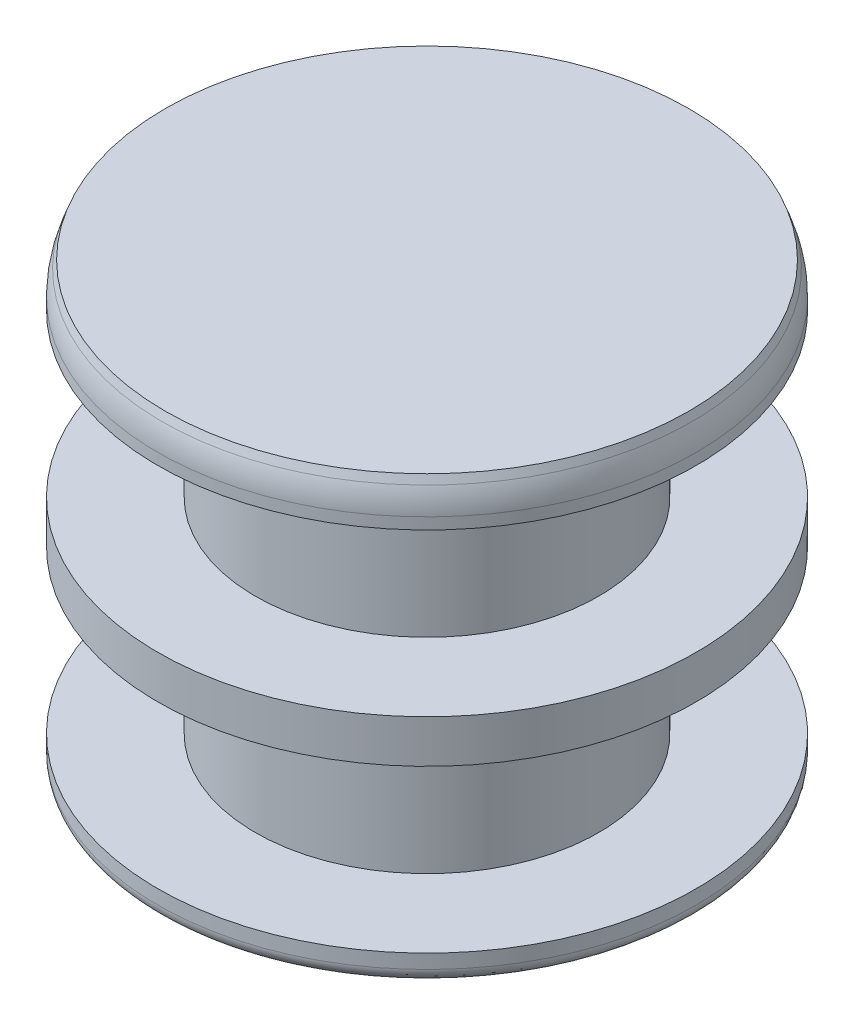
ISO-10303-21;
HEADER;
FILE_DESCRIPTION(('STEP AP214'),'2;1');
FILE_NAME('part.step','',(''),(''),'','','');
FILE_SCHEMA(('AUTOMOTIVE_DESIGN { 1 0 10303 214 1 1 1 1 }'));
ENDSEC;
DATA;
#1=APPLICATION_CONTEXT('core data for automotive mechanical design processes');
#2=APPLICATION_PROTOCOL_DEFINITION('international standard','automotive_design',2000,#1);
#3=PRODUCT_CONTEXT('',#1,'mechanical');
#4=PRODUCT('Part','Part','',(#3));
#5=PRODUCT_RELATED_PRODUCT_CATEGORY('part','',(#4));
#6=PRODUCT_DEFINITION_FORMATION('','',#4);
#7=PRODUCT_DEFINITION_CONTEXT('part definition',#1,'design');
#8=PRODUCT_DEFINITION('design','',#6,#7);
#9=PRODUCT_DEFINITION_SHAPE('','',#8);
#10=(LENGTH_UNIT() NAMED_UNIT(*) SI_UNIT(.MILLI.,.METRE.));
#11=(NAMED_UNIT(*) PLANE_ANGLE_UNIT() SI_UNIT($,.RADIAN.));
#12=(NAMED_UNIT(*) SI_UNIT($,.STERADIAN.) SOLID_ANGLE_UNIT());
#13=UNCERTAINTY_MEASURE_WITH_UNIT(LENGTH_MEASURE(1.E-05),#10,'distance_accuracy_value','');
#14=(GEOMETRIC_REPRESENTATION_CONTEXT(3) GLOBAL_UNCERTAINTY_ASSIGNED_CONTEXT((#13)) GLOBAL_UNIT_ASSIGNED_CONTEXT((#10,
#11,#12)) REPRESENTATION_CONTEXT('',''));
#15=CARTESIAN_POINT('',(0.,0.,0.));
#16=DIRECTION('',(0.,0.,1.));
#17=DIRECTION('',(1.,0.,0.));
#18=AXIS2_PLACEMENT_3D('',#15,#16,#17);
#19=CARTESIAN_POINT('',(3.66,0.,0.));
#20=DIRECTION('',(0.,-1.,0.));
#21=DIRECTION('',(1.,0.,0.));
#22=AXIS2_PLACEMENT_3D('',#19,#20,#21);
#23=PLANE('',#22);
#24=CARTESIAN_POINT('',(0.,0.,0.));
#25=DIRECTION('',(0.,1.,0.));
#26=DIRECTION('',(-1.,0.,0.));
#27=AXIS2_PLACEMENT_3D('',#24,#25,#26);
#28=CIRCLE('',#27,3.66);
#29=CARTESIAN_POINT('',(-3.66,0.,0.));
#30=VERTEX_POINT('',#29);
#31=EDGE_CURVE('E81',#30,#30,#28,.T.);
#32=ORIENTED_EDGE('',*,*,#31,.T.);
#33=EDGE_LOOP('',(#32));
#34=FACE_BOUND('',#33,.T.);
#35=ADVANCED_FACE('F34',(#34),#23,.F.);
#36=CARTESIAN_POINT('',(0.500000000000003,-7.99956969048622,0.));
#37=DIRECTION('',(0.,1.,0.));
#38=DIRECTION('',(-1.,0.,0.));
#39=AXIS2_PLACEMENT_3D('',#36,#37,#38);
#40=PLANE('',#39);
#41=CARTESIAN_POINT('',(0.,-7.99956969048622,0.));
#42=DIRECTION('',(0.,1.,0.));
#43=DIRECTION('',(-1.,0.,0.));
#44=AXIS2_PLACEMENT_3D('',#41,#42,#43);
#45=CIRCLE('',#44,0.5);
#46=CARTESIAN_POINT('',(-0.499999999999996,-7.99956969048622,0.));
#47=VERTEX_POINT('',#46);
#48=EDGE_CURVE('E54',#47,#47,#45,.T.);
#49=ORIENTED_EDGE('',*,*,#48,.F.);
#50=EDGE_LOOP('',(#49));
#51=FACE_BOUND('',#50,.T.);
#52=ADVANCED_FACE('F99',(#51),#40,.F.);
#53=CARTESIAN_POINT('',(0.,-7.99956969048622,0.));
#54=DIRECTION('',(0.,1.,0.));
#55=DIRECTION('',(-1.,0.,0.));
#56=AXIS2_PLACEMENT_3D('',#53,#54,#55);
#57=CONICAL_SURFACE('',#56,0.5,1.02974425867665);
#58=CARTESIAN_POINT('',(0.,-6.09904297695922,0.));
#59=DIRECTION('',(0.,-1.,0.));
#60=DIRECTION('',(1.,0.,0.));
#61=AXIS2_PLACEMENT_3D('',#58,#59,#60);
#62=CIRCLE('',#61,3.66300761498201);
#63=CARTESIAN_POINT('',(-3.66300761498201,-6.09904297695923,0.));
#64=VERTEX_POINT('',#63);
#65=EDGE_CURVE('E45',#64,#64,#62,.T.);
#66=CARTESIAN_POINT('',(-3.66300761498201,-6.09904297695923,0.));
#67=CARTESIAN_POINT('',(-3.63005961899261,-6.11884013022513,0.));
#68=CARTESIAN_POINT('',(-3.59711162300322,-6.13863728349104,0.));
#69=CARTESIAN_POINT('',(-3.53121563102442,-6.17823159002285,0.));
#70=CARTESIAN_POINT('',(-3.49826763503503,-6.19802874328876,0.));
#71=CARTESIAN_POINT('',(-3.43237164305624,-6.23762304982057,0.));
#72=CARTESIAN_POINT('',(-3.39942364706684,-6.25742020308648,0.));
#73=CARTESIAN_POINT('',(-3.33352765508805,-6.29701450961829,0.));
#74=CARTESIAN_POINT('',(-3.30057965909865,-6.31681166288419,0.));
#75=CARTESIAN_POINT('',(-3.23468366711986,-6.35640596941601,0.));
#76=CARTESIAN_POINT('',(-3.20173567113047,-6.37620312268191,0.));
#77=CARTESIAN_POINT('',(-3.13583967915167,-6.41579742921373,0.));
#78=CARTESIAN_POINT('',(-3.10289168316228,-6.43559458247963,0.));
#79=CARTESIAN_POINT('',(-3.03699569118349,-6.47518888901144,0.));
#80=CARTESIAN_POINT('',(-3.00404769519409,-6.49498604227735,0.));
#81=CARTESIAN_POINT('',(-2.9381517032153,-6.53458034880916,0.));
#82=CARTESIAN_POINT('',(-2.9052037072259,-6.55437750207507,0.));
#83=CARTESIAN_POINT('',(-2.83930771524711,-6.59397180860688,0.));
#84=CARTESIAN_POINT('',(-2.80635971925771,-6.61376896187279,0.));
#85=CARTESIAN_POINT('',(-2.74046372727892,-6.6533632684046,0.));
#86=CARTESIAN_POINT('',(-2.70751573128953,-6.67316042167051,0.));
#87=CARTESIAN_POINT('',(-2.64161973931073,-6.71275472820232,0.));
#88=CARTESIAN_POINT('',(-2.60867174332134,-6.73255188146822,0.));
#89=CARTESIAN_POINT('',(-2.54277575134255,-6.77214618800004,0.));
#90=CARTESIAN_POINT('',(-2.50982775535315,-6.79194334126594,0.));
#91=CARTESIAN_POINT('',(-2.44393176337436,-6.83153764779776,0.));
#92=CARTESIAN_POINT('',(-2.41098376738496,-6.85133480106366,0.));
#93=CARTESIAN_POINT('',(-2.34508777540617,-6.89092910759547,0.));
#94=CARTESIAN_POINT('',(-2.31213977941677,-6.91072626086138,0.));
#95=CARTESIAN_POINT('',(-2.24624378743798,-6.95032056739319,0.));
#96=CARTESIAN_POINT('',(-2.21329579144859,-6.9701177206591,0.));
#97=CARTESIAN_POINT('',(-2.14739979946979,-7.00971202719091,0.));
#98=CARTESIAN_POINT('',(-2.1144518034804,-7.02950918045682,0.));
#99=CARTESIAN_POINT('',(-2.04855581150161,-7.06910348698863,0.));
#100=CARTESIAN_POINT('',(-2.01560781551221,-7.08890064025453,0.));
#101=CARTESIAN_POINT('',(-1.94971182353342,-7.12849494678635,0.));
#102=CARTESIAN_POINT('',(-1.91676382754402,-7.14829210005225,0.));
#103=CARTESIAN_POINT('',(-1.85086783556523,-7.18788640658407,0.));
#104=CARTESIAN_POINT('',(-1.81791983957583,-7.20768355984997,0.));
#105=CARTESIAN_POINT('',(-1.75202384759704,-7.24727786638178,0.));
#106=CARTESIAN_POINT('',(-1.71907585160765,-7.26707501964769,0.));
#107=CARTESIAN_POINT('',(-1.65317985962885,-7.3066693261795,0.));
#108=CARTESIAN_POINT('',(-1.62023186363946,-7.32646647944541,0.));
#109=CARTESIAN_POINT('',(-1.55433587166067,-7.36606078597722,0.));
#110=CARTESIAN_POINT('',(-1.52138787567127,-7.38585793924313,0.));
#111=CARTESIAN_POINT('',(-1.45549188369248,-7.42545224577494,0.));
#112=CARTESIAN_POINT('',(-1.42254388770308,-7.44524939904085,0.));
#113=CARTESIAN_POINT('',(-1.35664789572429,-7.48484370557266,0.));
#114=CARTESIAN_POINT('',(-1.32369989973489,-7.50464085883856,0.));
#115=CARTESIAN_POINT('',(-1.2578039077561,-7.54423516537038,0.));
#116=CARTESIAN_POINT('',(-1.22485591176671,-7.56403231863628,0.));
#117=CARTESIAN_POINT('',(-1.15895991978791,-7.6036266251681,0.));
#118=CARTESIAN_POINT('',(-1.12601192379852,-7.623423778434,0.));
#119=CARTESIAN_POINT('',(-1.06011593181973,-7.66301808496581,0.));
#120=CARTESIAN_POINT('',(-1.02716793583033,-7.68281523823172,0.));
#121=CARTESIAN_POINT('',(-0.961271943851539,-7.72240954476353,0.));
#122=CARTESIAN_POINT('',(-0.928323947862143,-7.74220669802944,0.));
#123=CARTESIAN_POINT('',(-0.862427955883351,-7.78180100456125,0.));
#124=CARTESIAN_POINT('',(-0.829479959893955,-7.80159815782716,0.));
#125=CARTESIAN_POINT('',(-0.763583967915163,-7.84119246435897,0.));
#126=CARTESIAN_POINT('',(-0.730635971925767,-7.86098961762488,0.));
#127=CARTESIAN_POINT('',(-0.664739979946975,-7.90058392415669,0.));
#128=CARTESIAN_POINT('',(-0.631791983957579,-7.9203810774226,0.));
#129=CARTESIAN_POINT('',(-0.565895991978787,-7.95997538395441,0.));
#130=CARTESIAN_POINT('',(-0.532947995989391,-7.97977253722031,0.));
#131=CARTESIAN_POINT('',(-0.499999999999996,-7.99956969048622,0.));
#132=B_SPLINE_CURVE_WITH_KNOTS('',3,(#66,#67,#68,#69,#70,#71,#72,#73,#74,#75,#76,#77,#78,#79,
#80,#81,#82,#83,#84,#85,#86,#87,#88,#89,#90,#91,#92,#93,#94,#95,#96,#97,#98,#99,#100,#101,#102,
#103,#104,#105,#106,#107,#108,#109,#110,#111,#112,#113,#114,#115,#116,#117,#118,#119,#120,#121,
#122,#123,#124,#125,#126,#127,#128,#129,#130,#131),.UNSPECIFIED.,.F.,.F.,(4,2,2,2,2,2,2,2,2,2,2,
2,2,2,2,2,2,2,2,2,2,2,2,2,2,2,2,2,2,2,2,2,4),(0.,0.115314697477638,0.230629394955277,
0.345944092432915,0.461258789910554,0.576573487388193,0.691888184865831,0.80720288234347,
0.922517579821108,1.03783227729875,1.15314697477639,1.26846167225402,1.38377636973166,
1.4990910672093,1.61440576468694,1.72972046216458,1.84503515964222,1.96034985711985,
2.07566455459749,2.19097925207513,2.30629394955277,2.42160864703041,2.53692334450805,
2.65223804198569,2.76755273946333,2.88286743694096,2.9981821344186,3.11349683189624,
3.22881152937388,3.34412622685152,3.45944092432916,3.5747556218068,3.69007031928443),.UNSPECIFIED.);
#133=EDGE_CURVE('BSEAM104',#64,#47,#132,.T.);
#134=ORIENTED_EDGE('',*,*,#65,.T.);
#135=ORIENTED_EDGE('',*,*,#48,.T.);
#136=ORIENTED_EDGE('',*,*,#133,.T.);
#137=ORIENTED_EDGE('',*,*,#133,.F.);
#138=EDGE_LOOP('',(#134,#136,#135,#137));
#139=FACE_BOUND('',#138,.T.);
#140=ADVANCED_FACE('F104',(#139),#57,.T.);
#141=CARTESIAN_POINT('',(0.,0.,0.));
#142=DIRECTION('',(0.,1.,0.));
#143=DIRECTION('',(-1.,0.,0.));
#144=AXIS2_PLACEMENT_3D('',#141,#142,#143);
#145=CYLINDRICAL_SURFACE('',#144,3.76);
#146=CARTESIAN_POINT('',(0.,-5.9276095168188,0.));
#147=DIRECTION('',(0.,-1.,0.));
#148=DIRECTION('',(1.,0.,0.));
#149=AXIS2_PLACEMENT_3D('',#146,#147,#148);
#150=CIRCLE('',#149,3.76);
#151=CARTESIAN_POINT('',(3.76,-5.9276095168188,0.));
#152=VERTEX_POINT('',#151);
#153=EDGE_CURVE('E49',#152,#152,#150,.F.);
#154=ORIENTED_EDGE('',*,*,#153,.T.);
#155=EDGE_LOOP('',(#154));
#156=FACE_BOUND('',#155,.T.);
#157=CARTESIAN_POINT('',(0.,-5.73,0.));
#158=DIRECTION('',(0.,1.,0.));
#159=DIRECTION('',(-1.,0.,0.));
#160=AXIS2_PLACEMENT_3D('',#157,#158,#159);
#161=CIRCLE('',#160,3.76);
#162=CARTESIAN_POINT('',(-3.76,-5.73,0.));
#163=VERTEX_POINT('',#162);
#164=EDGE_CURVE('E57',#163,#163,#161,.T.);
#165=ORIENTED_EDGE('',*,*,#164,.F.);
#166=EDGE_LOOP('',(#165));
#167=FACE_BOUND('',#166,.T.);
#168=ADVANCED_FACE('F110',(#156,#167),#145,.T.);
#169=CARTESIAN_POINT('',(3.76,-5.73,0.));
#170=DIRECTION('',(0.,-1.,0.));
#171=DIRECTION('',(1.,0.,0.));
#172=AXIS2_PLACEMENT_3D('',#169,#170,#171);
#173=PLANE('',#172);
#174=CARTESIAN_POINT('',(0.,-5.73,0.));
#175=DIRECTION('',(0.,1.,0.));
#176=DIRECTION('',(-1.,0.,0.));
#177=AXIS2_PLACEMENT_3D('',#174,#175,#176);
#178=CIRCLE('',#177,2.4);
#179=CARTESIAN_POINT('',(-2.4,-5.73,0.));
#180=VERTEX_POINT('',#179);
#181=EDGE_CURVE('E60',#180,#180,#178,.T.);
#182=ORIENTED_EDGE('',*,*,#181,.F.);
#183=EDGE_LOOP('',(#182));
#184=FACE_BOUND('',#183,.T.);
#185=ORIENTED_EDGE('',*,*,#164,.T.);
#186=EDGE_LOOP('',(#185));
#187=FACE_BOUND('',#186,.T.);
#188=ADVANCED_FACE('F114',(#184,#187),#173,.F.);
#189=CARTESIAN_POINT('',(0.,0.,0.));
#190=DIRECTION('',(0.,1.,0.));
#191=DIRECTION('',(-1.,0.,0.));
#192=AXIS2_PLACEMENT_3D('',#189,#190,#191);
#193=CYLINDRICAL_SURFACE('',#192,2.4);
#194=CARTESIAN_POINT('',(0.,-3.47,0.));
#195=DIRECTION('',(0.,1.,0.));
#196=DIRECTION('',(-1.,0.,0.));
#197=AXIS2_PLACEMENT_3D('',#194,#195,#196);
#198=CIRCLE('',#197,2.4);
#199=CARTESIAN_POINT('',(-2.4,-3.47,0.));
#200=VERTEX_POINT('',#199);
#201=EDGE_CURVE('E63',#200,#200,#198,.T.);
#202=ORIENTED_EDGE('',*,*,#201,.F.);
#203=EDGE_LOOP('',(#202));
#204=FACE_BOUND('',#203,.T.);
#205=ORIENTED_EDGE('',*,*,#181,.T.);
#206=EDGE_LOOP('',(#205));
#207=FACE_BOUND('',#206,.T.);
#208=ADVANCED_FACE('F118',(#204,#207),#193,.T.);
#209=CARTESIAN_POINT('',(2.4,-3.47,0.));
#210=DIRECTION('',(0.,1.,0.));
#211=DIRECTION('',(-1.,0.,0.));
#212=AXIS2_PLACEMENT_3D('',#209,#210,#211);
#213=PLANE('',#212);
#214=CARTESIAN_POINT('',(0.,-3.47,0.));
#215=DIRECTION('',(0.,1.,0.));
#216=DIRECTION('',(-1.,0.,0.));
#217=AXIS2_PLACEMENT_3D('',#214,#215,#216);
#218=CIRCLE('',#217,3.76);
#219=CARTESIAN_POINT('',(-3.76,-3.47,0.));
#220=VERTEX_POINT('',#219);
#221=EDGE_CURVE('E66',#220,#220,#218,.T.);
#222=ORIENTED_EDGE('',*,*,#221,.F.);
#223=EDGE_LOOP('',(#222));
#224=FACE_BOUND('',#223,.T.);
#225=ORIENTED_EDGE('',*,*,#201,.T.);
#226=EDGE_LOOP('',(#225));
#227=FACE_BOUND('',#226,.T.);
#228=ADVANCED_FACE('F122',(#224,#227),#213,.F.);
#229=CARTESIAN_POINT('',(0.,0.,0.));
#230=DIRECTION('',(0.,1.,0.));
#231=DIRECTION('',(-1.,0.,0.));
#232=AXIS2_PLACEMENT_3D('',#229,#230,#231);
#233=CYLINDRICAL_SURFACE('',#232,3.76);
#234=CARTESIAN_POINT('',(0.,-2.87,0.));
#235=DIRECTION('',(0.,1.,0.));
#236=DIRECTION('',(-1.,0.,0.));
#237=AXIS2_PLACEMENT_3D('',#234,#235,#236);
#238=CIRCLE('',#237,3.76);
#239=CARTESIAN_POINT('',(-3.76,-2.87,0.));
#240=VERTEX_POINT('',#239);
#241=EDGE_CURVE('E69',#240,#240,#238,.T.);
#242=ORIENTED_EDGE('',*,*,#241,.F.);
#243=EDGE_LOOP('',(#242));
#244=FACE_BOUND('',#243,.T.);
#245=ORIENTED_EDGE('',*,*,#221,.T.);
#246=EDGE_LOOP('',(#245));
#247=FACE_BOUND('',#246,.T.);
#248=ADVANCED_FACE('F126',(#244,#247),#233,.T.);
#249=CARTESIAN_POINT('',(3.76,-2.87,0.));
#250=DIRECTION('',(0.,-1.,0.));
#251=DIRECTION('',(1.,0.,0.));
#252=AXIS2_PLACEMENT_3D('',#249,#250,#251);
#253=PLANE('',#252);
#254=CARTESIAN_POINT('',(0.,-2.87,0.));
#255=DIRECTION('',(0.,1.,0.));
#256=DIRECTION('',(-1.,0.,0.));
#257=AXIS2_PLACEMENT_3D('',#254,#255,#256);
#258=CIRCLE('',#257,2.4);
#259=CARTESIAN_POINT('',(-2.4,-2.87,0.));
#260=VERTEX_POINT('',#259);
#261=EDGE_CURVE('E72',#260,#260,#258,.T.);
#262=ORIENTED_EDGE('',*,*,#261,.F.);
#263=EDGE_LOOP('',(#262));
#264=FACE_BOUND('',#263,.T.);
#265=ORIENTED_EDGE('',*,*,#241,.T.);
#266=EDGE_LOOP('',(#265));
#267=FACE_BOUND('',#266,.T.);
#268=ADVANCED_FACE('F130',(#264,#267),#253,.F.);
#269=CARTESIAN_POINT('',(0.,0.,0.));
#270=DIRECTION('',(0.,1.,0.));
#271=DIRECTION('',(-1.,0.,0.));
#272=AXIS2_PLACEMENT_3D('',#269,#270,#271);
#273=CYLINDRICAL_SURFACE('',#272,2.4);
#274=CARTESIAN_POINT('',(0.,-0.610000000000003,0.));
#275=DIRECTION('',(0.,1.,0.));
#276=DIRECTION('',(-1.,0.,0.));
#277=AXIS2_PLACEMENT_3D('',#274,#275,#276);
#278=CIRCLE('',#277,2.4);
#279=CARTESIAN_POINT('',(-2.4,-0.610000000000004,0.));
#280=VERTEX_POINT('',#279);
#281=EDGE_CURVE('E75',#280,#280,#278,.T.);
#282=ORIENTED_EDGE('',*,*,#281,.F.);
#283=EDGE_LOOP('',(#282));
#284=FACE_BOUND('',#283,.T.);
#285=ORIENTED_EDGE('',*,*,#261,.T.);
#286=EDGE_LOOP('',(#285));
#287=FACE_BOUND('',#286,.T.);
#288=ADVANCED_FACE('F134',(#284,#287),#273,.T.);
#289=CARTESIAN_POINT('',(2.4,-0.610000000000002,0.));
#290=DIRECTION('',(0.,1.,0.));
#291=DIRECTION('',(-1.,0.,0.));
#292=AXIS2_PLACEMENT_3D('',#289,#290,#291);
#293=PLANE('',#292);
#294=CARTESIAN_POINT('',(0.,-0.610000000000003,0.));
#295=DIRECTION('',(0.,1.,0.));
#296=DIRECTION('',(-1.,0.,0.));
#297=AXIS2_PLACEMENT_3D('',#294,#295,#296);
#298=CIRCLE('',#297,3.76);
#299=CARTESIAN_POINT('',(-3.76,-0.610000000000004,0.));
#300=VERTEX_POINT('',#299);
#301=EDGE_CURVE('E78',#300,#300,#298,.T.);
#302=ORIENTED_EDGE('',*,*,#301,.F.);
#303=EDGE_LOOP('',(#302));
#304=FACE_BOUND('',#303,.T.);
#305=ORIENTED_EDGE('',*,*,#281,.T.);
#306=EDGE_LOOP('',(#305));
#307=FACE_BOUND('',#306,.T.);
#308=ADVANCED_FACE('F96',(#304,#307),#293,.F.);
#309=CARTESIAN_POINT('',(0.,0.,0.));
#310=DIRECTION('',(0.,1.,0.));
#311=DIRECTION('',(-1.,0.,0.));
#312=AXIS2_PLACEMENT_3D('',#309,#310,#311);
#313=CYLINDRICAL_SURFACE('',#312,3.76);
#314=CARTESIAN_POINT('',(0.,-0.451074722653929,0.));
#315=DIRECTION('',(0.,-1.,0.));
#316=DIRECTION('',(1.,0.,0.));
#317=AXIS2_PLACEMENT_3D('',#314,#315,#316);
#318=CIRCLE('',#317,3.76);
#319=CARTESIAN_POINT('',(3.76,-0.451074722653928,0.));
#320=VERTEX_POINT('',#319);
#321=EDGE_CURVE('E10',#320,#320,#318,.T.);
#322=ORIENTED_EDGE('',*,*,#321,.T.);
#323=EDGE_LOOP('',(#322));
#324=FACE_BOUND('',#323,.T.);
#325=ORIENTED_EDGE('',*,*,#301,.T.);
#326=EDGE_LOOP('',(#325));
#327=FACE_BOUND('',#326,.T.);
#328=ADVANCED_FACE('F89',(#324,#327),#313,.T.);
#329=CARTESIAN_POINT('',(0.,-0.274747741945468,0.));
#330=DIRECTION('',(0.,-1.,0.));
#331=DIRECTION('',(1.,0.,0.));
#332=AXIS2_PLACEMENT_3D('',#329,#330,#331);
#333=CONICAL_SURFACE('',#332,3.76,0.34906585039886);
#334=CARTESIAN_POINT('',(0.,-0.109054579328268,0.));
#335=DIRECTION('',(0.,1.,0.));
#336=DIRECTION('',(-1.,0.,0.));
#337=AXIS2_PLACEMENT_3D('',#334,#335,#336);
#338=CIRCLE('',#337,3.69969262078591);
#339=CARTESIAN_POINT('',(-3.69969262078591,-0.10905457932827,0.));
#340=VERTEX_POINT('',#339);
#341=EDGE_CURVE('E41',#340,#340,#338,.T.);
#342=ORIENTED_EDGE('',*,*,#341,.T.);
#343=EDGE_LOOP('',(#342));
#344=FACE_BOUND('',#343,.T.);
#345=ORIENTED_EDGE('',*,*,#31,.F.);
#346=EDGE_LOOP('',(#345));
#347=FACE_BOUND('',#346,.T.);
#348=ADVANCED_FACE('F86',(#344,#347),#333,.T.);
#349=CARTESIAN_POINT('',(0.,-5.9276095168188,0.));
#350=DIRECTION('',(0.,-1.,0.));
#351=DIRECTION('',(1.,0.,0.));
#352=AXIS2_PLACEMENT_3D('',#349,#350,#351);
#353=TOROIDAL_SURFACE('',#352,3.56,0.2);
#354=ORIENTED_EDGE('',*,*,#65,.F.);
#355=EDGE_LOOP('',(#354));
#356=FACE_BOUND('',#355,.T.);
#357=ORIENTED_EDGE('',*,*,#153,.F.);
#358=EDGE_LOOP('',(#357));
#359=FACE_BOUND('',#358,.T.);
#360=ADVANCED_FACE('F88',(#356,#359),#353,.T.);
#361=CARTESIAN_POINT('',(0.,-0.451074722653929,0.));
#362=DIRECTION('',(0.,-1.,0.));
#363=DIRECTION('',(1.,0.,0.));
#364=AXIS2_PLACEMENT_3D('',#361,#362,#363);
#365=TOROIDAL_SURFACE('',#364,2.76,1.);
#366=ORIENTED_EDGE('',*,*,#321,.F.);
#367=EDGE_LOOP('',(#366));
#368=FACE_BOUND('',#367,.T.);
#369=ORIENTED_EDGE('',*,*,#341,.F.);
#370=EDGE_LOOP('',(#369));
#371=FACE_BOUND('',#370,.T.);
#372=ADVANCED_FACE('F36',(#368,#371),#365,.T.);
#373=CLOSED_SHELL('',(#35,#52,#140,#168,#188,#208,#228,#248,#268,#288,#308,#328,#348,#360,#372));
#374=MANIFOLD_SOLID_BREP('B2',#373);
#375=ADVANCED_BREP_SHAPE_REPRESENTATION('',(#18,#374),#14);
#376=SHAPE_DEFINITION_REPRESENTATION(#9,#375);
ENDSEC;
END-ISO-10303-21;
